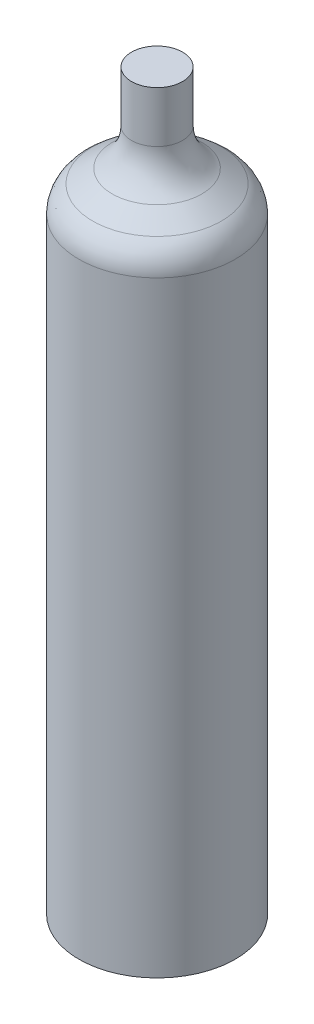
from build123d import *


with BuildPart() as part:
    # Esquisse1 → R_volution1 (revolve)
    with BuildSketch(Plane.XY, mode=Mode.PRIVATE) as r_volution1_sk:
        with BuildLine():
            Line((11.223922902, 118.171042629), (11.223922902, 138.171042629))
            Line((11.223922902, 138.171042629), (1.223922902, 138.171042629))
            Line((1.223922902, 138.171042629), (1.223922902, -149.365578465))
            Line((1.223922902, -149.365578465), (31.861129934, -149.365578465))
            Line((31.861129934, -149.365578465), (31.861129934, 88.171042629))
            ThreePointArc((31.861129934, 88.171042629), (30.432669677, 93.973200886), (26.473823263, 98.449033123))
            Line((26.473823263, 98.449033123), (18.766512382, 103.781168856))
            ThreePointArc((18.766512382, 103.781168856), (13.223862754, 110.047633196), (11.223922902, 118.171042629))
        make_face()
    revolve(r_volution1_sk.sketch.rotate(Axis((1.223922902, -151.865578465, 0), (0, 1, 0)), 90), axis=Axis((1.223922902, -151.865578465, 0), (0, 1, 0)))


solid = part.part
